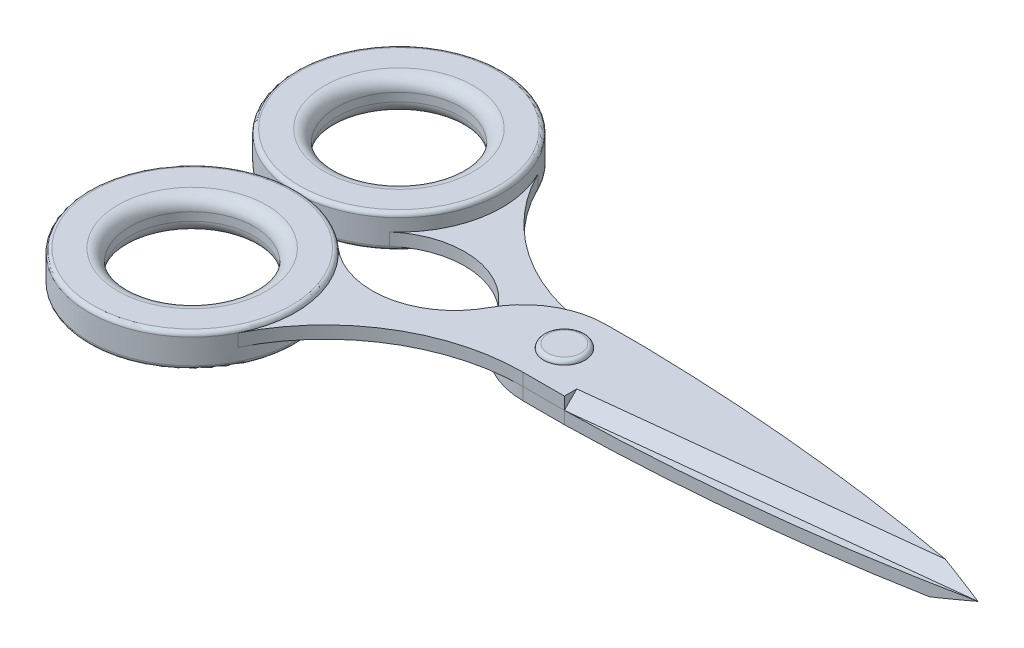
ISO-10303-21;
HEADER;
FILE_DESCRIPTION(('STEP AP214'),'2;1');
FILE_NAME('part.step','',(''),(''),'','','');
FILE_SCHEMA(('AUTOMOTIVE_DESIGN { 1 0 10303 214 1 1 1 1 }'));
ENDSEC;
DATA;
#1=APPLICATION_CONTEXT('core data for automotive mechanical design processes');
#2=APPLICATION_PROTOCOL_DEFINITION('international standard','automotive_design',2000,#1);
#3=PRODUCT_CONTEXT('',#1,'mechanical');
#4=PRODUCT('Part','Part','',(#3));
#5=PRODUCT_RELATED_PRODUCT_CATEGORY('part','',(#4));
#6=PRODUCT_DEFINITION_FORMATION('','',#4);
#7=PRODUCT_DEFINITION_CONTEXT('part definition',#1,'design');
#8=PRODUCT_DEFINITION('design','',#6,#7);
#9=PRODUCT_DEFINITION_SHAPE('','',#8);
#10=(LENGTH_UNIT() NAMED_UNIT(*) SI_UNIT(.MILLI.,.METRE.));
#11=(NAMED_UNIT(*) PLANE_ANGLE_UNIT() SI_UNIT($,.RADIAN.));
#12=(NAMED_UNIT(*) SI_UNIT($,.STERADIAN.) SOLID_ANGLE_UNIT());
#13=UNCERTAINTY_MEASURE_WITH_UNIT(LENGTH_MEASURE(1.E-05),#10,'distance_accuracy_value','');
#14=(GEOMETRIC_REPRESENTATION_CONTEXT(3) GLOBAL_UNCERTAINTY_ASSIGNED_CONTEXT((#13)) GLOBAL_UNIT_ASSIGNED_CONTEXT((#10,
#11,#12)) REPRESENTATION_CONTEXT('',''));
#15=CARTESIAN_POINT('',(0.,0.,0.));
#16=DIRECTION('',(0.,0.,1.));
#17=DIRECTION('',(1.,0.,0.));
#18=AXIS2_PLACEMENT_3D('',#15,#16,#17);
#19=CARTESIAN_POINT('',(0.0110875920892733,-3.00000000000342,-489.900211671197));
#20=DIRECTION('',(0.,1.,0.));
#21=DIRECTION('',(0.,0.,1.));
#22=AXIS2_PLACEMENT_3D('',#19,#20,#21);
#23=PLANE('',#22);
#24=CARTESIAN_POINT('',(0.,-3.,0.));
#25=DIRECTION('',(0.,1.,0.));
#26=DIRECTION('',(0.,0.,1.));
#27=AXIS2_PLACEMENT_3D('',#24,#25,#26);
#28=CIRCLE('',#27,5.);
#29=CARTESIAN_POINT('',(0.,-2.99999999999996,5.00000000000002));
#30=VERTEX_POINT('',#29);
#31=EDGE_CURVE('E154',#30,#30,#28,.F.);
#32=ORIENTED_EDGE('',*,*,#31,.F.);
#33=EDGE_LOOP('',(#32));
#34=FACE_BOUND('',#33,.T.);
#35=DIRECTION('',(-0.993883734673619,0.,-0.110431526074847));
#36=VECTOR('',#35,1.);
#37=CARTESIAN_POINT('',(101.09756097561,-2.99999999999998,3.12195121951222));
#38=LINE('',#37,#36);
#39=CARTESIAN_POINT('',(90.1571269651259,-2.99999999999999,1.90634744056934));
#40=VERTEX_POINT('',#39);
#41=CARTESIAN_POINT('',(10.,-3.00000000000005,-6.99999999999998));
#42=VERTEX_POINT('',#41);
#43=EDGE_CURVE('E211',#40,#42,#38,.T.);
#44=ORIENTED_EDGE('',*,*,#43,.F.);
#45=CARTESIAN_POINT('',(0.0110875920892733,-3.00000000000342,-489.900211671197));
#46=DIRECTION('',(0.,-1.,0.));
#47=DIRECTION('',(0.,0.,1.));
#48=AXIS2_PLACEMENT_3D('',#45,#46,#47);
#49=CIRCLE('',#48,500.);
#50=CARTESIAN_POINT('',(10.,-2.99999999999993,10.));
#51=VERTEX_POINT('',#50);
#52=EDGE_CURVE('E108',#40,#51,#49,.T.);
#53=ORIENTED_EDGE('',*,*,#52,.T.);
#54=DIRECTION('',(-1.,0.,0.));
#55=VECTOR('',#54,1.);
#56=CARTESIAN_POINT('',(0.,-2.99999999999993,10.));
#57=LINE('',#56,#55);
#58=CARTESIAN_POINT('',(0.,-2.99999999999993,10.));
#59=VERTEX_POINT('',#58);
#60=EDGE_CURVE('E101',#51,#59,#57,.T.);
#61=ORIENTED_EDGE('',*,*,#60,.T.);
#62=CARTESIAN_POINT('',(0.,-3.00000000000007,-9.99999999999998));
#63=DIRECTION('',(0.,1.,0.));
#64=DIRECTION('',(0.,0.,1.));
#65=AXIS2_PLACEMENT_3D('',#62,#63,#64);
#66=CIRCLE('',#65,20.);
#67=CARTESIAN_POINT('',(-17.6510061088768,-3.00000000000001,-0.595640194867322));
#68=VERTEX_POINT('',#67);
#69=EDGE_CURVE('E105',#68,#59,#66,.T.);
#70=ORIENTED_EDGE('',*,*,#69,.F.);
#71=CARTESIAN_POINT('',(-35.3020122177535,-2.99999999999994,8.80871961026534));
#72=DIRECTION('',(0.,1.,0.));
#73=DIRECTION('',(0.,0.,1.));
#74=AXIS2_PLACEMENT_3D('',#71,#72,#73);
#75=CIRCLE('',#74,20.);
#76=CARTESIAN_POINT('',(-48.501117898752,-3.00000000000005,-6.21737799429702));
#77=VERTEX_POINT('',#76);
#78=EDGE_CURVE('E127',#77,#68,#75,.F.);
#79=ORIENTED_EDGE('',*,*,#78,.F.);
#80=CARTESIAN_POINT('',(-65.,-3.00000000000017,-25.));
#81=DIRECTION('',(0.,1.,0.));
#82=DIRECTION('',(0.,0.,1.));
#83=AXIS2_PLACEMENT_3D('',#80,#81,#82);
#84=CIRCLE('',#83,25.);
#85=CARTESIAN_POINT('',(-42.6824034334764,-3.00000000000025,-36.2660944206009));
#86=VERTEX_POINT('',#85);
#87=EDGE_CURVE('E198',#86,#77,#84,.F.);
#88=ORIENTED_EDGE('',*,*,#87,.F.);
#89=CARTESIAN_POINT('',(0.,-3.00000000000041,-57.8125));
#90=DIRECTION('',(0.,1.,0.));
#91=DIRECTION('',(0.,0.,1.));
#92=AXIS2_PLACEMENT_3D('',#89,#90,#91);
#93=CIRCLE('',#92,47.8125);
#94=CARTESIAN_POINT('',(0.,-3.00000000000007,-9.99999999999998));
#95=VERTEX_POINT('',#94);
#96=EDGE_CURVE('E134',#95,#86,#93,.F.);
#97=ORIENTED_EDGE('',*,*,#96,.F.);
#98=DIRECTION('',(1.,0.,0.));
#99=VECTOR('',#98,1.);
#100=CARTESIAN_POINT('',(10.,-3.00000000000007,-9.99999999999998));
#101=LINE('',#100,#99);
#102=CARTESIAN_POINT('',(10.,-3.00000000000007,-9.99999999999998));
#103=VERTEX_POINT('',#102);
#104=EDGE_CURVE('E111',#95,#103,#101,.T.);
#105=ORIENTED_EDGE('',*,*,#104,.T.);
#106=DIRECTION('',(0.,0.,-1.));
#107=VECTOR('',#106,1.);
#108=CARTESIAN_POINT('',(10.,-3.00000000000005,-6.99999999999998));
#109=LINE('',#108,#107);
#110=EDGE_CURVE('E58',#42,#103,#109,.T.);
#111=ORIENTED_EDGE('',*,*,#110,.F.);
#112=EDGE_LOOP('',(#44,#53,#61,#70,#79,#88,#97,#105,#111));
#113=FACE_BOUND('',#112,.T.);
#114=ADVANCED_FACE('F41',(#34,#113),#23,.F.);
#115=CARTESIAN_POINT('',(0.0110875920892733,-3.00000000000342,-489.900211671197));
#116=DIRECTION('',(0.,1.,0.));
#117=DIRECTION('',(0.,0.,1.));
#118=AXIS2_PLACEMENT_3D('',#115,#116,#117);
#119=CYLINDRICAL_SURFACE('',#118,500.);
#120=CARTESIAN_POINT('',(0.0110875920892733,478.790332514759,-489.9002116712));
#121=DIRECTION('',(0.0783260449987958,-0.704934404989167,-0.704934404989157));
#122=DIRECTION('',(0.077846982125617,0.709272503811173,-0.700622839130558));
#123=AXIS2_PLACEMENT_3D('',#120,#121,#122);
#124=ELLIPSE('',#123,709.285851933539,500.);
#125=CARTESIAN_POINT('',(100.,0.,0.));
#126=VERTEX_POINT('',#125);
#127=EDGE_CURVE('E208',#126,#40,#124,.T.);
#128=ORIENTED_EDGE('',*,*,#127,.F.);
#129=CARTESIAN_POINT('',(0.0110875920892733,-3.42095687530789E-12,-489.900211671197));
#130=DIRECTION('',(0.,-1.,0.));
#131=DIRECTION('',(0.,0.,1.));
#132=AXIS2_PLACEMENT_3D('',#129,#130,#131);
#133=CIRCLE('',#132,500.);
#134=CARTESIAN_POINT('',(10.,0.,10.));
#135=VERTEX_POINT('',#134);
#136=EDGE_CURVE('E141',#126,#135,#133,.T.);
#137=ORIENTED_EDGE('',*,*,#136,.T.);
#138=DIRECTION('',(0.,1.,0.));
#139=VECTOR('',#138,1.);
#140=CARTESIAN_POINT('',(10.,-2.99999999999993,10.));
#141=LINE('',#140,#139);
#142=EDGE_CURVE('E118',#51,#135,#141,.T.);
#143=ORIENTED_EDGE('',*,*,#142,.F.);
#144=ORIENTED_EDGE('',*,*,#52,.F.);
#145=EDGE_LOOP('',(#128,#137,#143,#144));
#146=FACE_BOUND('',#145,.T.);
#147=ADVANCED_FACE('F238',(#146),#119,.T.);
#148=CARTESIAN_POINT('',(0.0110875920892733,-3.42095687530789E-12,-489.900211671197));
#149=DIRECTION('',(0.,1.,0.));
#150=DIRECTION('',(0.,0.,1.));
#151=AXIS2_PLACEMENT_3D('',#148,#149,#150);
#152=PLANE('',#151);
#153=CARTESIAN_POINT('',(0.,-4.03702763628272E-13,-57.8125));
#154=DIRECTION('',(0.,1.,0.));
#155=DIRECTION('',(0.,0.,1.));
#156=AXIS2_PLACEMENT_3D('',#153,#154,#155);
#157=CIRCLE('',#156,47.8125);
#158=CARTESIAN_POINT('',(-42.6824034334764,-2.532449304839E-13,-36.2660944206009));
#159=VERTEX_POINT('',#158);
#160=CARTESIAN_POINT('',(0.,0.,-10.));
#161=VERTEX_POINT('',#160);
#162=EDGE_CURVE('E125',#159,#161,#157,.T.);
#163=ORIENTED_EDGE('',*,*,#162,.F.);
#164=CARTESIAN_POINT('',(-65.,-1.74574168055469E-13,-25.));
#165=DIRECTION('',(0.,1.,0.));
#166=DIRECTION('',(0.,0.,1.));
#167=AXIS2_PLACEMENT_3D('',#164,#165,#166);
#168=CIRCLE('',#167,25.);
#169=CARTESIAN_POINT('',(-48.501117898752,0.,-6.21737799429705));
#170=VERTEX_POINT('',#169);
#171=EDGE_CURVE('E193',#159,#170,#168,.F.);
#172=ORIENTED_EDGE('',*,*,#171,.T.);
#173=CARTESIAN_POINT('',(-35.3020122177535,0.,8.80871961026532));
#174=DIRECTION('',(0.,1.,0.));
#175=DIRECTION('',(0.,0.,1.));
#176=AXIS2_PLACEMENT_3D('',#173,#174,#175);
#177=CIRCLE('',#176,20.);
#178=CARTESIAN_POINT('',(-17.6510061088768,0.,-0.595640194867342));
#179=VERTEX_POINT('',#178);
#180=EDGE_CURVE('E201',#179,#170,#177,.T.);
#181=ORIENTED_EDGE('',*,*,#180,.F.);
#182=CARTESIAN_POINT('',(0.,0.,-10.));
#183=DIRECTION('',(0.,-1.,0.));
#184=DIRECTION('',(0.,0.,-1.));
#185=AXIS2_PLACEMENT_3D('',#182,#183,#184);
#186=CIRCLE('',#185,20.);
#187=CARTESIAN_POINT('',(0.,0.,10.));
#188=VERTEX_POINT('',#187);
#189=EDGE_CURVE('E124',#188,#179,#186,.T.);
#190=ORIENTED_EDGE('',*,*,#189,.F.);
#191=DIRECTION('',(-1.,0.,0.));
#192=VECTOR('',#191,1.);
#193=CARTESIAN_POINT('',(0.,0.,10.));
#194=LINE('',#193,#192);
#195=EDGE_CURVE('E71',#135,#188,#194,.T.);
#196=ORIENTED_EDGE('',*,*,#195,.F.);
#197=ORIENTED_EDGE('',*,*,#136,.F.);
#198=DIRECTION('',(0.993883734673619,0.,0.110431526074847));
#199=VECTOR('',#198,1.);
#200=CARTESIAN_POINT('',(100.,0.,0.));
#201=LINE('',#200,#199);
#202=CARTESIAN_POINT('',(10.,0.,-10.));
#203=VERTEX_POINT('',#202);
#204=EDGE_CURVE('E137',#203,#126,#201,.T.);
#205=ORIENTED_EDGE('',*,*,#204,.F.);
#206=DIRECTION('',(1.,0.,0.));
#207=VECTOR('',#206,1.);
#208=CARTESIAN_POINT('',(10.,0.,-10.));
#209=LINE('',#208,#207);
#210=EDGE_CURVE('E146',#161,#203,#209,.T.);
#211=ORIENTED_EDGE('',*,*,#210,.F.);
#212=EDGE_LOOP('',(#163,#172,#181,#190,#196,#197,#205,#211));
#213=FACE_BOUND('',#212,.T.);
#214=ADVANCED_FACE('F232',(#213),#152,.T.);
#215=CARTESIAN_POINT('',(0.,-2.99999999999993,10.));
#216=DIRECTION('',(0.,0.,-1.));
#217=DIRECTION('',(1.,0.,0.));
#218=AXIS2_PLACEMENT_3D('',#215,#216,#217);
#219=PLANE('',#218);
#220=ORIENTED_EDGE('',*,*,#195,.T.);
#221=DIRECTION('',(0.,1.,0.));
#222=VECTOR('',#221,1.);
#223=CARTESIAN_POINT('',(0.,-2.99999999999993,10.));
#224=LINE('',#223,#222);
#225=EDGE_CURVE('E114',#59,#188,#224,.T.);
#226=ORIENTED_EDGE('',*,*,#225,.F.);
#227=ORIENTED_EDGE('',*,*,#60,.F.);
#228=ORIENTED_EDGE('',*,*,#142,.T.);
#229=EDGE_LOOP('',(#220,#226,#227,#228));
#230=FACE_BOUND('',#229,.T.);
#231=ADVANCED_FACE('F115',(#230),#219,.F.);
#232=CARTESIAN_POINT('',(10.,-3.00000000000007,-9.99999999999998));
#233=DIRECTION('',(0.,0.,1.));
#234=DIRECTION('',(-1.,0.,0.));
#235=AXIS2_PLACEMENT_3D('',#232,#233,#234);
#236=PLANE('',#235);
#237=ORIENTED_EDGE('',*,*,#210,.T.);
#238=DIRECTION('',(0.,1.,0.));
#239=VECTOR('',#238,1.);
#240=CARTESIAN_POINT('',(10.,-3.00000000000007,-9.99999999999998));
#241=LINE('',#240,#239);
#242=EDGE_CURVE('E140',#103,#203,#241,.T.);
#243=ORIENTED_EDGE('',*,*,#242,.F.);
#244=ORIENTED_EDGE('',*,*,#104,.F.);
#245=DIRECTION('',(0.,1.,0.));
#246=VECTOR('',#245,1.);
#247=CARTESIAN_POINT('',(0.,-3.00000000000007,-9.99999999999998));
#248=LINE('',#247,#246);
#249=EDGE_CURVE('E119',#95,#161,#248,.T.);
#250=ORIENTED_EDGE('',*,*,#249,.T.);
#251=EDGE_LOOP('',(#237,#243,#244,#250));
#252=FACE_BOUND('',#251,.T.);
#253=ADVANCED_FACE('F228',(#252),#236,.F.);
#254=CARTESIAN_POINT('',(0.,-111.16653826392,-57.8124999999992));
#255=DIRECTION('',(0.,1.,0.));
#256=DIRECTION('',(0.,0.,1.));
#257=AXIS2_PLACEMENT_3D('',#254,#255,#256);
#258=CYLINDRICAL_SURFACE('',#257,47.8125);
#259=ORIENTED_EDGE('',*,*,#249,.F.);
#260=ORIENTED_EDGE('',*,*,#96,.T.);
#261=DIRECTION('',(0.,1.,0.));
#262=VECTOR('',#261,1.);
#263=CARTESIAN_POINT('',(-42.6824034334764,-111.16653826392,-36.2660944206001));
#264=LINE('',#263,#262);
#265=EDGE_CURVE('E130',#86,#159,#264,.T.);
#266=ORIENTED_EDGE('',*,*,#265,.T.);
#267=ORIENTED_EDGE('',*,*,#162,.T.);
#268=EDGE_LOOP('',(#259,#260,#266,#267));
#269=FACE_BOUND('',#268,.T.);
#270=ADVANCED_FACE('F245',(#269),#258,.F.);
#271=CARTESIAN_POINT('',(0.,-111.16653826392,-9.99999999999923));
#272=DIRECTION('',(0.,1.,0.));
#273=DIRECTION('',(0.,0.,1.));
#274=AXIS2_PLACEMENT_3D('',#271,#272,#273);
#275=CYLINDRICAL_SURFACE('',#274,20.);
#276=DIRECTION('',(0.,1.,0.));
#277=VECTOR('',#276,1.);
#278=CARTESIAN_POINT('',(-17.6510061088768,-111.16653826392,-0.595640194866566));
#279=LINE('',#278,#277);
#280=EDGE_CURVE('E122',#68,#179,#279,.T.);
#281=ORIENTED_EDGE('',*,*,#280,.F.);
#282=ORIENTED_EDGE('',*,*,#69,.T.);
#283=ORIENTED_EDGE('',*,*,#225,.T.);
#284=ORIENTED_EDGE('',*,*,#189,.T.);
#285=EDGE_LOOP('',(#281,#282,#283,#284));
#286=FACE_BOUND('',#285,.T.);
#287=ADVANCED_FACE('F121',(#286),#275,.T.);
#288=CARTESIAN_POINT('',(-35.3020122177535,-111.16653826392,8.8087196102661));
#289=DIRECTION('',(0.,1.,0.));
#290=DIRECTION('',(0.,0.,1.));
#291=AXIS2_PLACEMENT_3D('',#288,#289,#290);
#292=CYLINDRICAL_SURFACE('',#291,20.);
#293=DIRECTION('',(0.,1.,0.));
#294=VECTOR('',#293,1.);
#295=CARTESIAN_POINT('',(-48.501117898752,-111.16653826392,-6.21737799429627));
#296=LINE('',#295,#294);
#297=EDGE_CURVE('E144',#77,#170,#296,.T.);
#298=ORIENTED_EDGE('',*,*,#297,.F.);
#299=ORIENTED_EDGE('',*,*,#78,.T.);
#300=ORIENTED_EDGE('',*,*,#280,.T.);
#301=ORIENTED_EDGE('',*,*,#180,.T.);
#302=EDGE_LOOP('',(#298,#299,#300,#301));
#303=FACE_BOUND('',#302,.T.);
#304=ADVANCED_FACE('F189',(#303),#292,.F.);
#305=CARTESIAN_POINT('',(-65.,-111.16653826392,-24.9999999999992));
#306=DIRECTION('',(0.,1.,0.));
#307=DIRECTION('',(0.,0.,1.));
#308=AXIS2_PLACEMENT_3D('',#305,#306,#307);
#309=CYLINDRICAL_SURFACE('',#308,25.);
#310=CARTESIAN_POINT('',(-65.,2.99999999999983,-25.));
#311=DIRECTION('',(0.,-1.,0.));
#312=DIRECTION('',(0.,0.,-1.));
#313=AXIS2_PLACEMENT_3D('',#310,#311,#312);
#314=CIRCLE('',#313,25.);
#315=CARTESIAN_POINT('',(-65.,2.99999999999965,-50.));
#316=VERTEX_POINT('',#315);
#317=EDGE_CURVE('E173',#316,#316,#314,.T.);
#318=ORIENTED_EDGE('',*,*,#317,.T.);
#319=EDGE_LOOP('',(#318));
#320=FACE_BOUND('',#319,.T.);
#321=ORIENTED_EDGE('',*,*,#265,.F.);
#322=CARTESIAN_POINT('',(-65.,-3.00000000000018,-25.));
#323=DIRECTION('',(0.,-1.,0.));
#324=DIRECTION('',(0.,0.,-1.));
#325=AXIS2_PLACEMENT_3D('',#322,#323,#324);
#326=CIRCLE('',#325,25.);
#327=EDGE_CURVE('E82',#86,#77,#326,.F.);
#328=ORIENTED_EDGE('',*,*,#327,.T.);
#329=ORIENTED_EDGE('',*,*,#297,.T.);
#330=ORIENTED_EDGE('',*,*,#171,.F.);
#331=EDGE_LOOP('',(#321,#328,#329,#330));
#332=FACE_BOUND('',#331,.T.);
#333=ADVANCED_FACE('F187',(#320,#332),#309,.T.);
#334=CARTESIAN_POINT('',(-65.,3.99999999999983,-25.));
#335=DIRECTION('',(0.,-1.,0.));
#336=DIRECTION('',(0.,0.,-1.));
#337=AXIS2_PLACEMENT_3D('',#334,#335,#336);
#338=PLANE('',#337);
#339=CARTESIAN_POINT('',(-65.,3.99999999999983,-25.));
#340=DIRECTION('',(0.,-1.,0.));
#341=DIRECTION('',(0.,0.,-1.));
#342=AXIS2_PLACEMENT_3D('',#339,#340,#341);
#343=CIRCLE('',#342,24.);
#344=CARTESIAN_POINT('',(-65.,3.99999999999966,-49.));
#345=VERTEX_POINT('',#344);
#346=EDGE_CURVE('E50',#345,#345,#343,.F.);
#347=ORIENTED_EDGE('',*,*,#346,.T.);
#348=EDGE_LOOP('',(#347));
#349=FACE_BOUND('',#348,.T.);
#350=CARTESIAN_POINT('',(-65.,3.99999999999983,-25.));
#351=DIRECTION('',(0.,-1.,0.));
#352=DIRECTION('',(0.,0.,-1.));
#353=AXIS2_PLACEMENT_3D('',#350,#351,#352);
#354=CIRCLE('',#353,18.);
#355=CARTESIAN_POINT('',(-65.,3.9999999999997,-43.));
#356=VERTEX_POINT('',#355);
#357=EDGE_CURVE('E157',#356,#356,#354,.T.);
#358=ORIENTED_EDGE('',*,*,#357,.T.);
#359=EDGE_LOOP('',(#358));
#360=FACE_BOUND('',#359,.T.);
#361=ADVANCED_FACE('F178',(#349,#360),#338,.F.);
#362=CARTESIAN_POINT('',(-65.,-111.16653826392,-24.9999999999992));
#363=DIRECTION('',(0.,1.,0.));
#364=DIRECTION('',(0.,0.,1.));
#365=AXIS2_PLACEMENT_3D('',#362,#363,#364);
#366=CYLINDRICAL_SURFACE('',#365,15.);
#367=CARTESIAN_POINT('',(-65.,0.999999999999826,-25.));
#368=DIRECTION('',(0.,-1.,0.));
#369=DIRECTION('',(0.,0.,-1.));
#370=AXIS2_PLACEMENT_3D('',#367,#368,#369);
#371=CIRCLE('',#370,15.);
#372=CARTESIAN_POINT('',(-65.,0.999999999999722,-40.));
#373=VERTEX_POINT('',#372);
#374=EDGE_CURVE('E163',#373,#373,#371,.F.);
#375=ORIENTED_EDGE('',*,*,#374,.T.);
#376=EDGE_LOOP('',(#375));
#377=FACE_BOUND('',#376,.T.);
#378=CARTESIAN_POINT('',(-65.,-1.00000000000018,-25.));
#379=DIRECTION('',(0.,-1.,0.));
#380=DIRECTION('',(0.,0.,-1.));
#381=AXIS2_PLACEMENT_3D('',#378,#379,#380);
#382=CIRCLE('',#381,15.);
#383=CARTESIAN_POINT('',(-65.,-1.00000000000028,-40.));
#384=VERTEX_POINT('',#383);
#385=EDGE_CURVE('E160',#384,#384,#382,.T.);
#386=ORIENTED_EDGE('',*,*,#385,.T.);
#387=EDGE_LOOP('',(#386));
#388=FACE_BOUND('',#387,.T.);
#389=ADVANCED_FACE('F264',(#377,#388),#366,.F.);
#390=CARTESIAN_POINT('',(-65.,-4.00000000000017,-25.));
#391=DIRECTION('',(0.,-1.,0.));
#392=DIRECTION('',(0.,0.,-1.));
#393=AXIS2_PLACEMENT_3D('',#390,#391,#392);
#394=PLANE('',#393);
#395=CARTESIAN_POINT('',(-65.,-4.00000000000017,-25.));
#396=DIRECTION('',(0.,-1.,0.));
#397=DIRECTION('',(0.,0.,-1.));
#398=AXIS2_PLACEMENT_3D('',#395,#396,#397);
#399=CIRCLE('',#398,24.);
#400=CARTESIAN_POINT('',(-65.,-4.00000000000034,-49.));
#401=VERTEX_POINT('',#400);
#402=EDGE_CURVE('E12',#401,#401,#399,.T.);
#403=ORIENTED_EDGE('',*,*,#402,.T.);
#404=EDGE_LOOP('',(#403));
#405=FACE_BOUND('',#404,.T.);
#406=CARTESIAN_POINT('',(-65.,-4.00000000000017,-25.));
#407=DIRECTION('',(0.,-1.,0.));
#408=DIRECTION('',(0.,0.,-1.));
#409=AXIS2_PLACEMENT_3D('',#406,#407,#408);
#410=CIRCLE('',#409,18.);
#411=CARTESIAN_POINT('',(-65.,-4.0000000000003,-43.));
#412=VERTEX_POINT('',#411);
#413=EDGE_CURVE('E166',#412,#412,#410,.F.);
#414=ORIENTED_EDGE('',*,*,#413,.T.);
#415=EDGE_LOOP('',(#414));
#416=FACE_BOUND('',#415,.T.);
#417=ADVANCED_FACE('F286',(#405,#416),#394,.T.);
#418=CARTESIAN_POINT('',(0.,-4.,0.));
#419=DIRECTION('',(0.,-1.,0.));
#420=DIRECTION('',(0.,0.,-1.));
#421=AXIS2_PLACEMENT_3D('',#418,#419,#420);
#422=PLANE('',#421);
#423=CARTESIAN_POINT('',(0.,-4.,0.));
#424=DIRECTION('',(0.,-1.,0.));
#425=DIRECTION('',(0.,0.,-1.));
#426=AXIS2_PLACEMENT_3D('',#423,#424,#425);
#427=CIRCLE('',#426,4.);
#428=CARTESIAN_POINT('',(0.,-4.00000000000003,-3.99999999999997));
#429=VERTEX_POINT('',#428);
#430=EDGE_CURVE('E169',#429,#429,#427,.T.);
#431=ORIENTED_EDGE('',*,*,#430,.T.);
#432=EDGE_LOOP('',(#431));
#433=FACE_BOUND('',#432,.T.);
#434=ADVANCED_FACE('F284',(#433),#422,.T.);
#435=CARTESIAN_POINT('',(101.09756097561,0.,0.121951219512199));
#436=DIRECTION('',(0.0783260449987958,-0.704934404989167,-0.704934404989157));
#437=DIRECTION('',(0.,0.707106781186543,-0.707106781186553));
#438=AXIS2_PLACEMENT_3D('',#435,#436,#437);
#439=PLANE('',#438);
#440=ORIENTED_EDGE('',*,*,#127,.T.);
#441=ORIENTED_EDGE('',*,*,#43,.T.);
#442=DIRECTION('',(0.,-0.707106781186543,0.707106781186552));
#443=VECTOR('',#442,1.);
#444=CARTESIAN_POINT('',(10.,0.,-10.));
#445=LINE('',#444,#443);
#446=EDGE_CURVE('E215',#203,#42,#445,.T.);
#447=ORIENTED_EDGE('',*,*,#446,.F.);
#448=ORIENTED_EDGE('',*,*,#204,.T.);
#449=EDGE_LOOP('',(#440,#441,#447,#448));
#450=FACE_BOUND('',#449,.T.);
#451=ADVANCED_FACE('F235',(#450),#439,.T.);
#452=CARTESIAN_POINT('',(10.,-3.00000000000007,-9.99999999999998));
#453=DIRECTION('',(-1.,0.,0.));
#454=DIRECTION('',(0.,0.,-1.));
#455=AXIS2_PLACEMENT_3D('',#452,#453,#454);
#456=PLANE('',#455);
#457=ORIENTED_EDGE('',*,*,#242,.T.);
#458=ORIENTED_EDGE('',*,*,#446,.T.);
#459=ORIENTED_EDGE('',*,*,#110,.T.);
#460=EDGE_LOOP('',(#457,#458,#459));
#461=FACE_BOUND('',#460,.T.);
#462=ADVANCED_FACE('F218',(#461),#456,.F.);
#463=CARTESIAN_POINT('',(-65.,0.999999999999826,-25.));
#464=DIRECTION('',(0.,-1.,0.));
#465=DIRECTION('',(0.,0.,-1.));
#466=AXIS2_PLACEMENT_3D('',#463,#464,#465);
#467=TOROIDAL_SURFACE('',#466,18.,3.);
#468=ORIENTED_EDGE('',*,*,#374,.F.);
#469=EDGE_LOOP('',(#468));
#470=FACE_BOUND('',#469,.T.);
#471=ORIENTED_EDGE('',*,*,#357,.F.);
#472=EDGE_LOOP('',(#471));
#473=FACE_BOUND('',#472,.T.);
#474=ADVANCED_FACE('F269',(#470,#473),#467,.T.);
#475=CARTESIAN_POINT('',(-65.,-1.00000000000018,-25.));
#476=DIRECTION('',(0.,-1.,0.));
#477=DIRECTION('',(0.,0.,-1.));
#478=AXIS2_PLACEMENT_3D('',#475,#476,#477);
#479=TOROIDAL_SURFACE('',#478,18.,3.);
#480=ORIENTED_EDGE('',*,*,#413,.F.);
#481=EDGE_LOOP('',(#480));
#482=FACE_BOUND('',#481,.T.);
#483=ORIENTED_EDGE('',*,*,#385,.F.);
#484=EDGE_LOOP('',(#483));
#485=FACE_BOUND('',#484,.T.);
#486=ADVANCED_FACE('F272',(#482,#485),#479,.T.);
#487=CARTESIAN_POINT('',(0.,-3.,0.));
#488=DIRECTION('',(0.,-1.,0.));
#489=DIRECTION('',(0.,0.,-1.));
#490=AXIS2_PLACEMENT_3D('',#487,#488,#489);
#491=TOROIDAL_SURFACE('',#490,4.,1.);
#492=ORIENTED_EDGE('',*,*,#31,.T.);
#493=EDGE_LOOP('',(#492));
#494=FACE_BOUND('',#493,.T.);
#495=ORIENTED_EDGE('',*,*,#430,.F.);
#496=EDGE_LOOP('',(#495));
#497=FACE_BOUND('',#496,.T.);
#498=ADVANCED_FACE('F184',(#494,#497),#491,.T.);
#499=CARTESIAN_POINT('',(-65.,2.99999999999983,-25.));
#500=DIRECTION('',(0.,-1.,0.));
#501=DIRECTION('',(0.,0.,-1.));
#502=AXIS2_PLACEMENT_3D('',#499,#500,#501);
#503=TOROIDAL_SURFACE('',#502,24.,1.);
#504=ORIENTED_EDGE('',*,*,#346,.F.);
#505=EDGE_LOOP('',(#504));
#506=FACE_BOUND('',#505,.T.);
#507=ORIENTED_EDGE('',*,*,#317,.F.);
#508=EDGE_LOOP('',(#507));
#509=FACE_BOUND('',#508,.T.);
#510=ADVANCED_FACE('F181',(#506,#509),#503,.T.);
#511=CARTESIAN_POINT('',(-65.,-3.00000000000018,-25.));
#512=DIRECTION('',(0.,-1.,0.));
#513=DIRECTION('',(0.,0.,-1.));
#514=AXIS2_PLACEMENT_3D('',#511,#512,#513);
#515=TOROIDAL_SURFACE('',#514,24.,1.);
#516=ORIENTED_EDGE('',*,*,#327,.F.);
#517=ORIENTED_EDGE('',*,*,#87,.T.);
#518=EDGE_LOOP('',(#516,#517));
#519=FACE_BOUND('',#518,.T.);
#520=ORIENTED_EDGE('',*,*,#402,.F.);
#521=EDGE_LOOP('',(#520));
#522=FACE_BOUND('',#521,.T.);
#523=ADVANCED_FACE('F43',(#519,#522),#515,.T.);
#524=CLOSED_SHELL('',(#114,#147,#214,#231,#253,#270,#287,#304,#333,#361,#389,#417,#434,#451,
#462,#474,#486,#498,#510,#523));
#525=MANIFOLD_SOLID_BREP('B2',#524);
#526=CARTESIAN_POINT('',(0.0110875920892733,3.,489.900211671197));
#527=DIRECTION('',(0.,-1.,0.));
#528=DIRECTION('',(0.,0.,-1.));
#529=AXIS2_PLACEMENT_3D('',#526,#527,#528);
#530=PLANE('',#529);
#531=CARTESIAN_POINT('',(0.,3.,0.));
#532=DIRECTION('',(0.,-1.,0.));
#533=DIRECTION('',(0.,0.,-1.));
#534=AXIS2_PLACEMENT_3D('',#531,#532,#533);
#535=CIRCLE('',#534,5.);
#536=CARTESIAN_POINT('',(0.,3.,-5.));
#537=VERTEX_POINT('',#536);
#538=EDGE_CURVE('E554',#537,#537,#535,.F.);
#539=ORIENTED_EDGE('',*,*,#538,.F.);
#540=EDGE_LOOP('',(#539));
#541=FACE_BOUND('',#540,.T.);
#542=DIRECTION('',(-0.993883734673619,0.,0.110431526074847));
#543=VECTOR('',#542,1.);
#544=CARTESIAN_POINT('',(101.09756097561,3.,-3.1219512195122));
#545=LINE('',#544,#543);
#546=CARTESIAN_POINT('',(90.1571269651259,3.,-1.90634744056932));
#547=VERTEX_POINT('',#546);
#548=CARTESIAN_POINT('',(10.,3.,7.));
#549=VERTEX_POINT('',#548);
#550=EDGE_CURVE('E611',#547,#549,#545,.T.);
#551=ORIENTED_EDGE('',*,*,#550,.F.);
#552=CARTESIAN_POINT('',(0.0110875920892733,3.,489.900211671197));
#553=DIRECTION('',(0.,1.,0.));
#554=DIRECTION('',(0.,0.,-1.));
#555=AXIS2_PLACEMENT_3D('',#552,#553,#554);
#556=CIRCLE('',#555,500.);
#557=CARTESIAN_POINT('',(10.,3.,-10.));
#558=VERTEX_POINT('',#557);
#559=EDGE_CURVE('E508',#547,#558,#556,.T.);
#560=ORIENTED_EDGE('',*,*,#559,.T.);
#561=DIRECTION('',(-1.,0.,0.));
#562=VECTOR('',#561,1.);
#563=CARTESIAN_POINT('',(0.,3.,-10.));
#564=LINE('',#563,#562);
#565=CARTESIAN_POINT('',(0.,3.,-10.));
#566=VERTEX_POINT('',#565);
#567=EDGE_CURVE('E501',#558,#566,#564,.T.);
#568=ORIENTED_EDGE('',*,*,#567,.T.);
#569=CARTESIAN_POINT('',(0.,3.,10.));
#570=DIRECTION('',(0.,-1.,0.));
#571=DIRECTION('',(0.,0.,-1.));
#572=AXIS2_PLACEMENT_3D('',#569,#570,#571);
#573=CIRCLE('',#572,20.);
#574=CARTESIAN_POINT('',(-17.6510061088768,3.,0.595640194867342));
#575=VERTEX_POINT('',#574);
#576=EDGE_CURVE('E505',#575,#566,#573,.T.);
#577=ORIENTED_EDGE('',*,*,#576,.F.);
#578=CARTESIAN_POINT('',(-35.3020122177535,3.,-8.80871961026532));
#579=DIRECTION('',(0.,-1.,0.));
#580=DIRECTION('',(0.,0.,-1.));
#581=AXIS2_PLACEMENT_3D('',#578,#579,#580);
#582=CIRCLE('',#581,20.);
#583=CARTESIAN_POINT('',(-48.501117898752,3.,6.21737799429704));
#584=VERTEX_POINT('',#583);
#585=EDGE_CURVE('E527',#584,#575,#582,.F.);
#586=ORIENTED_EDGE('',*,*,#585,.F.);
#587=CARTESIAN_POINT('',(-65.,3.,25.));
#588=DIRECTION('',(0.,-1.,0.));
#589=DIRECTION('',(0.,0.,-1.));
#590=AXIS2_PLACEMENT_3D('',#587,#588,#589);
#591=CIRCLE('',#590,25.);
#592=CARTESIAN_POINT('',(-42.6824034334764,3.,36.2660944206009));
#593=VERTEX_POINT('',#592);
#594=EDGE_CURVE('E598',#593,#584,#591,.F.);
#595=ORIENTED_EDGE('',*,*,#594,.F.);
#596=CARTESIAN_POINT('',(0.,3.,57.8125));
#597=DIRECTION('',(0.,-1.,0.));
#598=DIRECTION('',(0.,0.,-1.));
#599=AXIS2_PLACEMENT_3D('',#596,#597,#598);
#600=CIRCLE('',#599,47.8125);
#601=CARTESIAN_POINT('',(0.,3.,10.));
#602=VERTEX_POINT('',#601);
#603=EDGE_CURVE('E534',#602,#593,#600,.F.);
#604=ORIENTED_EDGE('',*,*,#603,.F.);
#605=DIRECTION('',(1.,0.,0.));
#606=VECTOR('',#605,1.);
#607=CARTESIAN_POINT('',(10.,3.,10.));
#608=LINE('',#607,#606);
#609=CARTESIAN_POINT('',(10.,3.,10.));
#610=VERTEX_POINT('',#609);
#611=EDGE_CURVE('E511',#602,#610,#608,.T.);
#612=ORIENTED_EDGE('',*,*,#611,.T.);
#613=DIRECTION('',(0.,0.,1.));
#614=VECTOR('',#613,1.);
#615=CARTESIAN_POINT('',(10.,3.,7.));
#616=LINE('',#615,#614);
#617=EDGE_CURVE('E458',#549,#610,#616,.T.);
#618=ORIENTED_EDGE('',*,*,#617,.F.);
#619=EDGE_LOOP('',(#551,#560,#568,#577,#586,#595,#604,#612,#618));
#620=FACE_BOUND('',#619,.T.);
#621=ADVANCED_FACE('F441',(#541,#620),#530,.F.);
#622=CARTESIAN_POINT('',(0.0110875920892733,3.,489.900211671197));
#623=DIRECTION('',(0.,-1.,0.));
#624=DIRECTION('',(0.,0.,-1.));
#625=AXIS2_PLACEMENT_3D('',#622,#623,#624);
#626=CYLINDRICAL_SURFACE('',#625,500.);
#627=CARTESIAN_POINT('',(0.0110875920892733,-478.790332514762,489.900211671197));
#628=DIRECTION('',(0.0783260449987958,0.704934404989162,0.704934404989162));
#629=DIRECTION('',(0.077846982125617,-0.709272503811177,0.700622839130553));
#630=AXIS2_PLACEMENT_3D('',#627,#628,#629);
#631=ELLIPSE('',#630,709.285851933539,500.);
#632=CARTESIAN_POINT('',(100.,0.,0.));
#633=VERTEX_POINT('',#632);
#634=EDGE_CURVE('E608',#633,#547,#631,.T.);
#635=ORIENTED_EDGE('',*,*,#634,.F.);
#636=CARTESIAN_POINT('',(0.0110875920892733,0.,489.900211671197));
#637=DIRECTION('',(0.,1.,0.));
#638=DIRECTION('',(0.,0.,-1.));
#639=AXIS2_PLACEMENT_3D('',#636,#637,#638);
#640=CIRCLE('',#639,500.);
#641=CARTESIAN_POINT('',(10.,0.,-10.));
#642=VERTEX_POINT('',#641);
#643=EDGE_CURVE('E541',#633,#642,#640,.T.);
#644=ORIENTED_EDGE('',*,*,#643,.T.);
#645=DIRECTION('',(0.,-1.,0.));
#646=VECTOR('',#645,1.);
#647=CARTESIAN_POINT('',(10.,3.,-10.));
#648=LINE('',#647,#646);
#649=EDGE_CURVE('E518',#558,#642,#648,.T.);
#650=ORIENTED_EDGE('',*,*,#649,.F.);
#651=ORIENTED_EDGE('',*,*,#559,.F.);
#652=EDGE_LOOP('',(#635,#644,#650,#651));
#653=FACE_BOUND('',#652,.T.);
#654=ADVANCED_FACE('F638',(#653),#626,.T.);
#655=CARTESIAN_POINT('',(0.0110875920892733,0.,489.900211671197));
#656=DIRECTION('',(0.,-1.,0.));
#657=DIRECTION('',(0.,0.,-1.));
#658=AXIS2_PLACEMENT_3D('',#655,#656,#657);
#659=PLANE('',#658);
#660=CARTESIAN_POINT('',(0.,0.,57.8125));
#661=DIRECTION('',(0.,-1.,0.));
#662=DIRECTION('',(0.,0.,-1.));
#663=AXIS2_PLACEMENT_3D('',#660,#661,#662);
#664=CIRCLE('',#663,47.8125);
#665=CARTESIAN_POINT('',(-42.6824034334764,0.,36.2660944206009));
#666=VERTEX_POINT('',#665);
#667=CARTESIAN_POINT('',(0.,0.,10.));
#668=VERTEX_POINT('',#667);
#669=EDGE_CURVE('E525',#666,#668,#664,.T.);
#670=ORIENTED_EDGE('',*,*,#669,.F.);
#671=CARTESIAN_POINT('',(-65.,0.,25.));
#672=DIRECTION('',(0.,-1.,0.));
#673=DIRECTION('',(0.,0.,-1.));
#674=AXIS2_PLACEMENT_3D('',#671,#672,#673);
#675=CIRCLE('',#674,25.);
#676=CARTESIAN_POINT('',(-48.501117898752,0.,6.21737799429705));
#677=VERTEX_POINT('',#676);
#678=EDGE_CURVE('E593',#666,#677,#675,.F.);
#679=ORIENTED_EDGE('',*,*,#678,.T.);
#680=CARTESIAN_POINT('',(-35.3020122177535,0.,-8.80871961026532));
#681=DIRECTION('',(0.,-1.,0.));
#682=DIRECTION('',(0.,0.,-1.));
#683=AXIS2_PLACEMENT_3D('',#680,#681,#682);
#684=CIRCLE('',#683,20.);
#685=CARTESIAN_POINT('',(-17.6510061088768,0.,0.595640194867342));
#686=VERTEX_POINT('',#685);
#687=EDGE_CURVE('E601',#686,#677,#684,.T.);
#688=ORIENTED_EDGE('',*,*,#687,.F.);
#689=CARTESIAN_POINT('',(0.,0.,10.));
#690=DIRECTION('',(0.,1.,0.));
#691=DIRECTION('',(0.,0.,1.));
#692=AXIS2_PLACEMENT_3D('',#689,#690,#691);
#693=CIRCLE('',#692,20.);
#694=CARTESIAN_POINT('',(0.,0.,-10.));
#695=VERTEX_POINT('',#694);
#696=EDGE_CURVE('E524',#695,#686,#693,.T.);
#697=ORIENTED_EDGE('',*,*,#696,.F.);
#698=DIRECTION('',(-1.,0.,0.));
#699=VECTOR('',#698,1.);
#700=CARTESIAN_POINT('',(0.,0.,-10.));
#701=LINE('',#700,#699);
#702=EDGE_CURVE('E471',#642,#695,#701,.T.);
#703=ORIENTED_EDGE('',*,*,#702,.F.);
#704=ORIENTED_EDGE('',*,*,#643,.F.);
#705=DIRECTION('',(0.993883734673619,0.,-0.110431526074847));
#706=VECTOR('',#705,1.);
#707=CARTESIAN_POINT('',(100.,0.,0.));
#708=LINE('',#707,#706);
#709=CARTESIAN_POINT('',(10.,0.,10.));
#710=VERTEX_POINT('',#709);
#711=EDGE_CURVE('E537',#710,#633,#708,.T.);
#712=ORIENTED_EDGE('',*,*,#711,.F.);
#713=DIRECTION('',(1.,0.,0.));
#714=VECTOR('',#713,1.);
#715=CARTESIAN_POINT('',(10.,0.,10.));
#716=LINE('',#715,#714);
#717=EDGE_CURVE('E546',#668,#710,#716,.T.);
#718=ORIENTED_EDGE('',*,*,#717,.F.);
#719=EDGE_LOOP('',(#670,#679,#688,#697,#703,#704,#712,#718));
#720=FACE_BOUND('',#719,.T.);
#721=ADVANCED_FACE('F632',(#720),#659,.T.);
#722=CARTESIAN_POINT('',(0.,3.,-10.));
#723=DIRECTION('',(0.,0.,1.));
#724=DIRECTION('',(1.,0.,0.));
#725=AXIS2_PLACEMENT_3D('',#722,#723,#724);
#726=PLANE('',#725);
#727=ORIENTED_EDGE('',*,*,#702,.T.);
#728=DIRECTION('',(0.,-1.,0.));
#729=VECTOR('',#728,1.);
#730=CARTESIAN_POINT('',(0.,3.,-10.));
#731=LINE('',#730,#729);
#732=EDGE_CURVE('E514',#566,#695,#731,.T.);
#733=ORIENTED_EDGE('',*,*,#732,.F.);
#734=ORIENTED_EDGE('',*,*,#567,.F.);
#735=ORIENTED_EDGE('',*,*,#649,.T.);
#736=EDGE_LOOP('',(#727,#733,#734,#735));
#737=FACE_BOUND('',#736,.T.);
#738=ADVANCED_FACE('F515',(#737),#726,.F.);
#739=CARTESIAN_POINT('',(10.,3.,10.));
#740=DIRECTION('',(0.,0.,-1.));
#741=DIRECTION('',(-1.,0.,0.));
#742=AXIS2_PLACEMENT_3D('',#739,#740,#741);
#743=PLANE('',#742);
#744=ORIENTED_EDGE('',*,*,#717,.T.);
#745=DIRECTION('',(0.,-1.,0.));
#746=VECTOR('',#745,1.);
#747=CARTESIAN_POINT('',(10.,3.,10.));
#748=LINE('',#747,#746);
#749=EDGE_CURVE('E540',#610,#710,#748,.T.);
#750=ORIENTED_EDGE('',*,*,#749,.F.);
#751=ORIENTED_EDGE('',*,*,#611,.F.);
#752=DIRECTION('',(0.,-1.,0.));
#753=VECTOR('',#752,1.);
#754=CARTESIAN_POINT('',(0.,3.,10.));
#755=LINE('',#754,#753);
#756=EDGE_CURVE('E519',#602,#668,#755,.T.);
#757=ORIENTED_EDGE('',*,*,#756,.T.);
#758=EDGE_LOOP('',(#744,#750,#751,#757));
#759=FACE_BOUND('',#758,.T.);
#760=ADVANCED_FACE('F628',(#759),#743,.F.);
#761=CARTESIAN_POINT('',(0.,111.16653826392,57.8125));
#762=DIRECTION('',(0.,-1.,0.));
#763=DIRECTION('',(0.,0.,-1.));
#764=AXIS2_PLACEMENT_3D('',#761,#762,#763);
#765=CYLINDRICAL_SURFACE('',#764,47.8125);
#766=ORIENTED_EDGE('',*,*,#756,.F.);
#767=ORIENTED_EDGE('',*,*,#603,.T.);
#768=DIRECTION('',(0.,-1.,0.));
#769=VECTOR('',#768,1.);
#770=CARTESIAN_POINT('',(-42.6824034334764,111.16653826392,36.2660944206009));
#771=LINE('',#770,#769);
#772=EDGE_CURVE('E530',#593,#666,#771,.T.);
#773=ORIENTED_EDGE('',*,*,#772,.T.);
#774=ORIENTED_EDGE('',*,*,#669,.T.);
#775=EDGE_LOOP('',(#766,#767,#773,#774));
#776=FACE_BOUND('',#775,.T.);
#777=ADVANCED_FACE('F645',(#776),#765,.F.);
#778=CARTESIAN_POINT('',(0.,111.16653826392,10.));
#779=DIRECTION('',(0.,-1.,0.));
#780=DIRECTION('',(0.,0.,-1.));
#781=AXIS2_PLACEMENT_3D('',#778,#779,#780);
#782=CYLINDRICAL_SURFACE('',#781,20.);
#783=DIRECTION('',(0.,-1.,0.));
#784=VECTOR('',#783,1.);
#785=CARTESIAN_POINT('',(-17.6510061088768,111.16653826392,0.595640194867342));
#786=LINE('',#785,#784);
#787=EDGE_CURVE('E522',#575,#686,#786,.T.);
#788=ORIENTED_EDGE('',*,*,#787,.F.);
#789=ORIENTED_EDGE('',*,*,#576,.T.);
#790=ORIENTED_EDGE('',*,*,#732,.T.);
#791=ORIENTED_EDGE('',*,*,#696,.T.);
#792=EDGE_LOOP('',(#788,#789,#790,#791));
#793=FACE_BOUND('',#792,.T.);
#794=ADVANCED_FACE('F521',(#793),#782,.T.);
#795=CARTESIAN_POINT('',(-35.3020122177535,111.16653826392,-8.80871961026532));
#796=DIRECTION('',(0.,-1.,0.));
#797=DIRECTION('',(0.,0.,-1.));
#798=AXIS2_PLACEMENT_3D('',#795,#796,#797);
#799=CYLINDRICAL_SURFACE('',#798,20.);
#800=DIRECTION('',(0.,-1.,0.));
#801=VECTOR('',#800,1.);
#802=CARTESIAN_POINT('',(-48.501117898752,111.16653826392,6.21737799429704));
#803=LINE('',#802,#801);
#804=EDGE_CURVE('E544',#584,#677,#803,.T.);
#805=ORIENTED_EDGE('',*,*,#804,.F.);
#806=ORIENTED_EDGE('',*,*,#585,.T.);
#807=ORIENTED_EDGE('',*,*,#787,.T.);
#808=ORIENTED_EDGE('',*,*,#687,.T.);
#809=EDGE_LOOP('',(#805,#806,#807,#808));
#810=FACE_BOUND('',#809,.T.);
#811=ADVANCED_FACE('F589',(#810),#799,.F.);
#812=CARTESIAN_POINT('',(-65.,111.16653826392,25.));
#813=DIRECTION('',(0.,-1.,0.));
#814=DIRECTION('',(0.,0.,-1.));
#815=AXIS2_PLACEMENT_3D('',#812,#813,#814);
#816=CYLINDRICAL_SURFACE('',#815,25.);
#817=CARTESIAN_POINT('',(-65.,-3.,25.));
#818=DIRECTION('',(0.,1.,0.));
#819=DIRECTION('',(0.,0.,1.));
#820=AXIS2_PLACEMENT_3D('',#817,#818,#819);
#821=CIRCLE('',#820,25.);
#822=CARTESIAN_POINT('',(-65.,-3.,50.));
#823=VERTEX_POINT('',#822);
#824=EDGE_CURVE('E573',#823,#823,#821,.T.);
#825=ORIENTED_EDGE('',*,*,#824,.T.);
#826=EDGE_LOOP('',(#825));
#827=FACE_BOUND('',#826,.T.);
#828=ORIENTED_EDGE('',*,*,#772,.F.);
#829=CARTESIAN_POINT('',(-65.,3.,25.));
#830=DIRECTION('',(0.,1.,0.));
#831=DIRECTION('',(0.,0.,1.));
#832=AXIS2_PLACEMENT_3D('',#829,#830,#831);
#833=CIRCLE('',#832,25.);
#834=EDGE_CURVE('E482',#593,#584,#833,.F.);
#835=ORIENTED_EDGE('',*,*,#834,.T.);
#836=ORIENTED_EDGE('',*,*,#804,.T.);
#837=ORIENTED_EDGE('',*,*,#678,.F.);
#838=EDGE_LOOP('',(#828,#835,#836,#837));
#839=FACE_BOUND('',#838,.T.);
#840=ADVANCED_FACE('F587',(#827,#839),#816,.T.);
#841=CARTESIAN_POINT('',(-65.,-4.,25.));
#842=DIRECTION('',(0.,1.,0.));
#843=DIRECTION('',(0.,0.,1.));
#844=AXIS2_PLACEMENT_3D('',#841,#842,#843);
#845=PLANE('',#844);
#846=CARTESIAN_POINT('',(-65.,-4.,25.));
#847=DIRECTION('',(0.,1.,0.));
#848=DIRECTION('',(0.,0.,1.));
#849=AXIS2_PLACEMENT_3D('',#846,#847,#848);
#850=CIRCLE('',#849,24.);
#851=CARTESIAN_POINT('',(-65.,-4.,49.));
#852=VERTEX_POINT('',#851);
#853=EDGE_CURVE('E450',#852,#852,#850,.F.);
#854=ORIENTED_EDGE('',*,*,#853,.T.);
#855=EDGE_LOOP('',(#854));
#856=FACE_BOUND('',#855,.T.);
#857=CARTESIAN_POINT('',(-65.,-4.,25.));
#858=DIRECTION('',(0.,1.,0.));
#859=DIRECTION('',(0.,0.,1.));
#860=AXIS2_PLACEMENT_3D('',#857,#858,#859);
#861=CIRCLE('',#860,18.);
#862=CARTESIAN_POINT('',(-65.,-4.,43.));
#863=VERTEX_POINT('',#862);
#864=EDGE_CURVE('E557',#863,#863,#861,.T.);
#865=ORIENTED_EDGE('',*,*,#864,.T.);
#866=EDGE_LOOP('',(#865));
#867=FACE_BOUND('',#866,.T.);
#868=ADVANCED_FACE('F578',(#856,#867),#845,.F.);
#869=CARTESIAN_POINT('',(-65.,111.16653826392,25.));
#870=DIRECTION('',(0.,-1.,0.));
#871=DIRECTION('',(0.,0.,-1.));
#872=AXIS2_PLACEMENT_3D('',#869,#870,#871);
#873=CYLINDRICAL_SURFACE('',#872,15.);
#874=CARTESIAN_POINT('',(-65.,-1.,25.));
#875=DIRECTION('',(0.,1.,0.));
#876=DIRECTION('',(0.,0.,1.));
#877=AXIS2_PLACEMENT_3D('',#874,#875,#876);
#878=CIRCLE('',#877,15.);
#879=CARTESIAN_POINT('',(-65.,-1.,40.));
#880=VERTEX_POINT('',#879);
#881=EDGE_CURVE('E563',#880,#880,#878,.F.);
#882=ORIENTED_EDGE('',*,*,#881,.T.);
#883=EDGE_LOOP('',(#882));
#884=FACE_BOUND('',#883,.T.);
#885=CARTESIAN_POINT('',(-65.,1.,25.));
#886=DIRECTION('',(0.,1.,0.));
#887=DIRECTION('',(0.,0.,1.));
#888=AXIS2_PLACEMENT_3D('',#885,#886,#887);
#889=CIRCLE('',#888,15.);
#890=CARTESIAN_POINT('',(-65.,1.,40.));
#891=VERTEX_POINT('',#890);
#892=EDGE_CURVE('E560',#891,#891,#889,.T.);
#893=ORIENTED_EDGE('',*,*,#892,.T.);
#894=EDGE_LOOP('',(#893));
#895=FACE_BOUND('',#894,.T.);
#896=ADVANCED_FACE('F664',(#884,#895),#873,.F.);
#897=CARTESIAN_POINT('',(-65.,4.,25.));
#898=DIRECTION('',(0.,1.,0.));
#899=DIRECTION('',(0.,0.,1.));
#900=AXIS2_PLACEMENT_3D('',#897,#898,#899);
#901=PLANE('',#900);
#902=CARTESIAN_POINT('',(-65.,4.,25.));
#903=DIRECTION('',(0.,1.,0.));
#904=DIRECTION('',(0.,0.,1.));
#905=AXIS2_PLACEMENT_3D('',#902,#903,#904);
#906=CIRCLE('',#905,24.);
#907=CARTESIAN_POINT('',(-65.,4.,49.));
#908=VERTEX_POINT('',#907);
#909=EDGE_CURVE('E39',#908,#908,#906,.T.);
#910=ORIENTED_EDGE('',*,*,#909,.T.);
#911=EDGE_LOOP('',(#910));
#912=FACE_BOUND('',#911,.T.);
#913=CARTESIAN_POINT('',(-65.,4.,25.));
#914=DIRECTION('',(0.,1.,0.));
#915=DIRECTION('',(0.,0.,1.));
#916=AXIS2_PLACEMENT_3D('',#913,#914,#915);
#917=CIRCLE('',#916,18.);
#918=CARTESIAN_POINT('',(-65.,4.,43.));
#919=VERTEX_POINT('',#918);
#920=EDGE_CURVE('E566',#919,#919,#917,.F.);
#921=ORIENTED_EDGE('',*,*,#920,.T.);
#922=EDGE_LOOP('',(#921));
#923=FACE_BOUND('',#922,.T.);
#924=ADVANCED_FACE('F686',(#912,#923),#901,.T.);
#925=CARTESIAN_POINT('',(0.,4.,0.));
#926=DIRECTION('',(0.,1.,0.));
#927=DIRECTION('',(0.,0.,1.));
#928=AXIS2_PLACEMENT_3D('',#925,#926,#927);
#929=PLANE('',#928);
#930=CARTESIAN_POINT('',(0.,4.,0.));
#931=DIRECTION('',(0.,1.,0.));
#932=DIRECTION('',(0.,0.,1.));
#933=AXIS2_PLACEMENT_3D('',#930,#931,#932);
#934=CIRCLE('',#933,4.);
#935=CARTESIAN_POINT('',(0.,4.,4.));
#936=VERTEX_POINT('',#935);
#937=EDGE_CURVE('E569',#936,#936,#934,.T.);
#938=ORIENTED_EDGE('',*,*,#937,.T.);
#939=EDGE_LOOP('',(#938));
#940=FACE_BOUND('',#939,.T.);
#941=ADVANCED_FACE('F684',(#940),#929,.T.);
#942=CARTESIAN_POINT('',(101.09756097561,0.,-0.121951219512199));
#943=DIRECTION('',(0.0783260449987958,0.704934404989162,0.704934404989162));
#944=DIRECTION('',(0.,-0.707106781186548,0.707106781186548));
#945=AXIS2_PLACEMENT_3D('',#942,#943,#944);
#946=PLANE('',#945);
#947=ORIENTED_EDGE('',*,*,#634,.T.);
#948=ORIENTED_EDGE('',*,*,#550,.T.);
#949=DIRECTION('',(0.,0.707106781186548,-0.707106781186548));
#950=VECTOR('',#949,1.);
#951=CARTESIAN_POINT('',(10.,0.,10.));
#952=LINE('',#951,#950);
#953=EDGE_CURVE('E615',#710,#549,#952,.T.);
#954=ORIENTED_EDGE('',*,*,#953,.F.);
#955=ORIENTED_EDGE('',*,*,#711,.T.);
#956=EDGE_LOOP('',(#947,#948,#954,#955));
#957=FACE_BOUND('',#956,.T.);
#958=ADVANCED_FACE('F635',(#957),#946,.T.);
#959=CARTESIAN_POINT('',(10.,3.,10.));
#960=DIRECTION('',(-1.,0.,0.));
#961=DIRECTION('',(0.,0.,1.));
#962=AXIS2_PLACEMENT_3D('',#959,#960,#961);
#963=PLANE('',#962);
#964=ORIENTED_EDGE('',*,*,#749,.T.);
#965=ORIENTED_EDGE('',*,*,#953,.T.);
#966=ORIENTED_EDGE('',*,*,#617,.T.);
#967=EDGE_LOOP('',(#964,#965,#966));
#968=FACE_BOUND('',#967,.T.);
#969=ADVANCED_FACE('F618',(#968),#963,.F.);
#970=CARTESIAN_POINT('',(-65.,-1.,25.));
#971=DIRECTION('',(0.,1.,0.));
#972=DIRECTION('',(0.,0.,1.));
#973=AXIS2_PLACEMENT_3D('',#970,#971,#972);
#974=TOROIDAL_SURFACE('',#973,18.,3.);
#975=ORIENTED_EDGE('',*,*,#881,.F.);
#976=EDGE_LOOP('',(#975));
#977=FACE_BOUND('',#976,.T.);
#978=ORIENTED_EDGE('',*,*,#864,.F.);
#979=EDGE_LOOP('',(#978));
#980=FACE_BOUND('',#979,.T.);
#981=ADVANCED_FACE('F669',(#977,#980),#974,.T.);
#982=CARTESIAN_POINT('',(-65.,1.,25.));
#983=DIRECTION('',(0.,1.,0.));
#984=DIRECTION('',(0.,0.,1.));
#985=AXIS2_PLACEMENT_3D('',#982,#983,#984);
#986=TOROIDAL_SURFACE('',#985,18.,3.);
#987=ORIENTED_EDGE('',*,*,#920,.F.);
#988=EDGE_LOOP('',(#987));
#989=FACE_BOUND('',#988,.T.);
#990=ORIENTED_EDGE('',*,*,#892,.F.);
#991=EDGE_LOOP('',(#990));
#992=FACE_BOUND('',#991,.T.);
#993=ADVANCED_FACE('F672',(#989,#992),#986,.T.);
#994=CARTESIAN_POINT('',(0.,3.,0.));
#995=DIRECTION('',(0.,1.,0.));
#996=DIRECTION('',(0.,0.,1.));
#997=AXIS2_PLACEMENT_3D('',#994,#995,#996);
#998=TOROIDAL_SURFACE('',#997,4.,1.);
#999=ORIENTED_EDGE('',*,*,#538,.T.);
#1000=EDGE_LOOP('',(#999));
#1001=FACE_BOUND('',#1000,.T.);
#1002=ORIENTED_EDGE('',*,*,#937,.F.);
#1003=EDGE_LOOP('',(#1002));
#1004=FACE_BOUND('',#1003,.T.);
#1005=ADVANCED_FACE('F584',(#1001,#1004),#998,.T.);
#1006=CARTESIAN_POINT('',(-65.,-3.,25.));
#1007=DIRECTION('',(0.,1.,0.));
#1008=DIRECTION('',(0.,0.,1.));
#1009=AXIS2_PLACEMENT_3D('',#1006,#1007,#1008);
#1010=TOROIDAL_SURFACE('',#1009,24.,1.);
#1011=ORIENTED_EDGE('',*,*,#853,.F.);
#1012=EDGE_LOOP('',(#1011));
#1013=FACE_BOUND('',#1012,.T.);
#1014=ORIENTED_EDGE('',*,*,#824,.F.);
#1015=EDGE_LOOP('',(#1014));
#1016=FACE_BOUND('',#1015,.T.);
#1017=ADVANCED_FACE('F581',(#1013,#1016),#1010,.T.);
#1018=CARTESIAN_POINT('',(-65.,3.,25.));
#1019=DIRECTION('',(0.,1.,0.));
#1020=DIRECTION('',(0.,0.,1.));
#1021=AXIS2_PLACEMENT_3D('',#1018,#1019,#1020);
#1022=TOROIDAL_SURFACE('',#1021,24.,1.);
#1023=ORIENTED_EDGE('',*,*,#834,.F.);
#1024=ORIENTED_EDGE('',*,*,#594,.T.);
#1025=EDGE_LOOP('',(#1023,#1024));
#1026=FACE_BOUND('',#1025,.T.);
#1027=ORIENTED_EDGE('',*,*,#909,.F.);
#1028=EDGE_LOOP('',(#1027));
#1029=FACE_BOUND('',#1028,.T.);
#1030=ADVANCED_FACE('F443',(#1026,#1029),#1022,.T.);
#1031=CLOSED_SHELL('',(#621,#654,#721,#738,#760,#777,#794,#811,#840,#868,#896,#924,#941,#958,
#969,#981,#993,#1005,#1017,#1030));
#1032=MANIFOLD_SOLID_BREP('B6',#1031);
#1033=ADVANCED_BREP_SHAPE_REPRESENTATION('',(#18,#525,#1032),#14);
#1034=SHAPE_DEFINITION_REPRESENTATION(#9,#1033);
ENDSEC;
END-ISO-10303-21;
